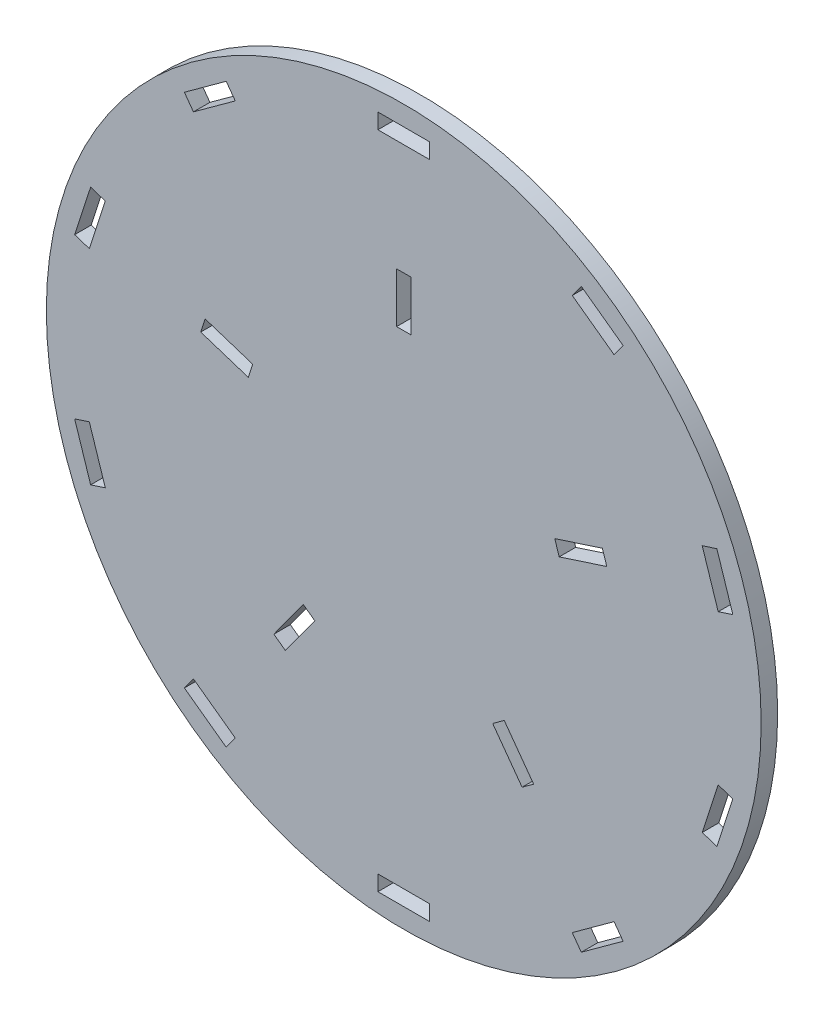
from build123d import *

# Parameters (mm, degrees)
SKETCH1_R           = 65
SKETCH1_W           = 9.4
SKETCH1_H           = 2.8
SKETCH1_W_2         = 2.6
SKETCH1_H_2         = 9.1
BOSS_EXTRUDE1_DEPTH = 3


with BuildPart() as part:
    # Sketch1 → Boss-Extrude1 (new body)
    with BuildSketch(Plane.XY):
        Circle(SKETCH1_R)
        with Locations((0, 60)):
            Rectangle(SKETCH1_W, SKETCH1_H, mode=Mode.SUBTRACT)
        Polygon((30.641835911, 50.170986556), (38.246595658, 44.645805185), (39.892394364, 46.911052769), (32.287634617, 52.43623414), align=None, mode=Mode.SUBTRACT)
        Polygon((54.279531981, 22.578361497), (57.184291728, 13.638430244), (59.847249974, 14.503677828), (56.942490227, 23.443609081), align=None, mode=Mode.SUBTRACT)
        Polygon((57.184291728, -13.638430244), (54.279531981, -22.578361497), (56.942490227, -23.443609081), (59.847249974, -14.503677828), align=None, mode=Mode.SUBTRACT)
        Polygon((38.246595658, -44.645805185), (30.641835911, -50.170986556), (32.287634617, -52.43623414), (39.892394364, -46.911052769), align=None, mode=Mode.SUBTRACT)
        with Locations((0, -60)):
            Rectangle(SKETCH1_W, SKETCH1_H, mode=Mode.SUBTRACT)
        Polygon((-30.641835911, -50.170986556), (-38.246595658, -44.645805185), (-39.892394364, -46.911052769), (-32.287634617, -52.43623414), align=None, mode=Mode.SUBTRACT)
        Polygon((-54.279531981, -22.578361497), (-57.184291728, -13.638430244), (-59.847249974, -14.503677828), (-56.942490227, -23.443609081), align=None, mode=Mode.SUBTRACT)
        Polygon((-57.184291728, 13.638430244), (-54.279531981, 22.578361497), (-56.942490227, 23.443609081), (-59.847249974, 14.503677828), align=None, mode=Mode.SUBTRACT)
        Polygon((-38.246595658, 44.645805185), (-30.641835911, 50.170986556), (-32.287634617, 52.43623414), (-39.892394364, 46.911052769), align=None, mode=Mode.SUBTRACT)
        with Locations((0, 33.85)):
            Rectangle(SKETCH1_W_2, SKETCH1_H_2, mode=Mode.SUBTRACT)
        Polygon((36.118848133, 13.102626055), (36.922292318, 10.629879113), (28.26767802, 7.817824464), (27.464233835, 10.290571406), align=None, mode=Mode.SUBTRACT)
        Polygon((23.622675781, -30.302131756), (21.519231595, -31.830373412), (16.170385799, -24.468318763), (18.273829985, -22.940077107), align=None, mode=Mode.SUBTRACT)
        Polygon((-21.519231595, -31.830373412), (-23.622675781, -30.302131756), (-18.273829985, -22.940077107), (-16.170385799, -24.468318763), align=None, mode=Mode.SUBTRACT)
        Polygon((-36.922292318, 10.629879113), (-36.118848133, 13.102626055), (-27.464233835, 10.290571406), (-28.26767802, 7.817824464), align=None, mode=Mode.SUBTRACT)
    extrude(amount=BOSS_EXTRUDE1_DEPTH)


solid = part.part
